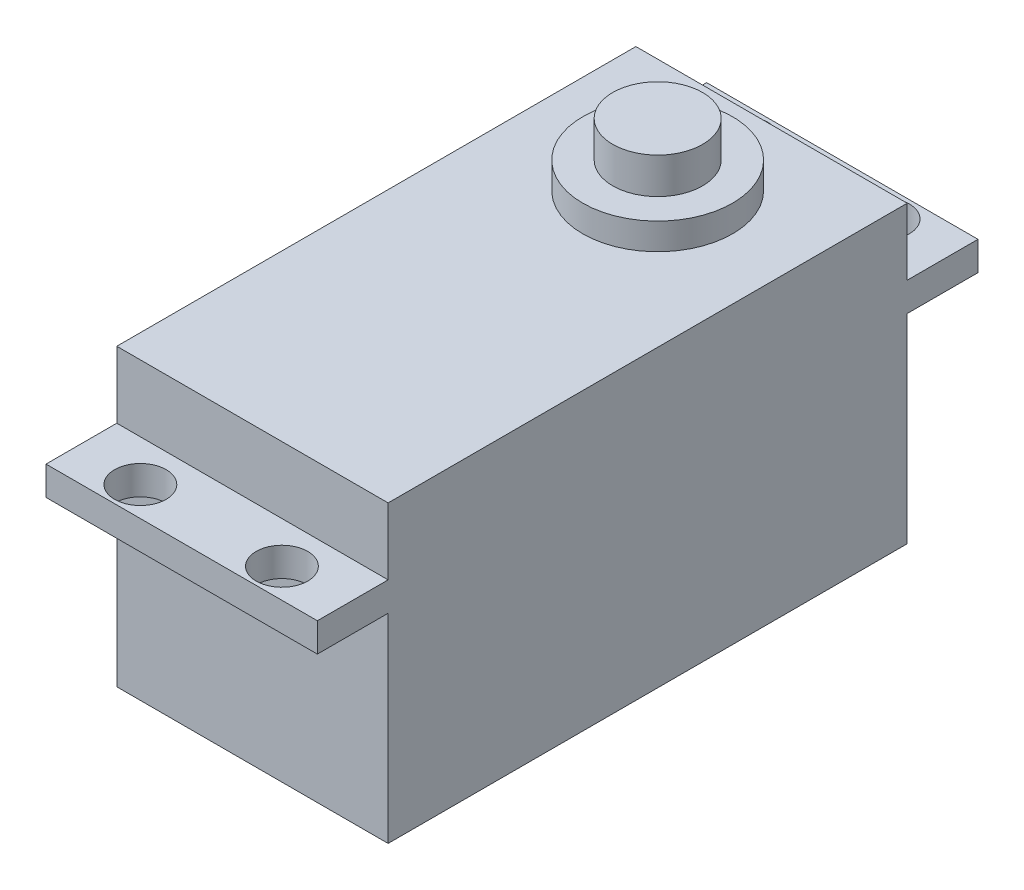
from build123d import *

# Parameters (mm, degrees)
SKETCH1_W               = 23
SKETCH1_H               = 44
EXTRUDE1_DEPTH          = 25
SKETCH3_W               = 23
SKETCH3_H               = 2.45
EXTRUDE3_DEPTH          = 6
SKETCH5_R               = 2.1844
CUT_EXTRUDE1_DEPTH      = 36.925930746
MIRROR3_COPY_1_SKETCH_R = 2.1844
MIRROR3_COPY_1_DEPTH    = 36.925930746
SKETCH4_R               = 6.35
EXTRUDE4_DEPTH          = 2.252
SKETCH6_R               = 3.81
EXTRUDE5_DEPTH          = 3.048


with BuildPart() as part:
    # Sketch1 → Extrude1 (new body)
    with BuildSketch(Plane(origin=(0, 0, 0), x_dir=(1, 0, 0), z_dir=(0, 1, 0))):
        Rectangle(SKETCH1_W, SKETCH1_H)
    extrude(amount=EXTRUDE1_DEPTH)

    # Sketch3 → Extrude3 (add)
    with BuildSketch(Plane.XY.offset(22)):
        with Locations((0, 18.125)):
            Rectangle(SKETCH3_W, SKETCH3_H)
    extrude3 = extrude(amount=EXTRUDE3_DEPTH)

    # Mirror1: Extrude3 across plane
    add(extrude3.mirror(Plane.XY))

    # Sketch5 → Cut-Extrude1 (cut, through all)
    with BuildSketch(Plane(origin=(0, 19.35, 0), x_dir=(1, 0, 0), z_dir=(0, 1, 0))):
        with Locations(Location((6, -25.5, 0), (0, 0, 270))):
            Circle(SKETCH5_R)
    cut_extrude1 = extrude(amount=-CUT_EXTRUDE1_DEPTH, mode=Mode.SUBTRACT)

    # Mirror2: Cut-Extrude1 across plane
    add(cut_extrude1.mirror(Plane.XY), mode=Mode.SUBTRACT)

    # Mirror3: Cut-Extrude1 across plane
    add(cut_extrude1.mirror(Plane(origin=(0, 0, 0), x_dir=(0, 0, 1), z_dir=(1, 0, 0))), mode=Mode.SUBTRACT)

    # Mirror3 copy 1 sketch → Mirror3 copy 1 (cut, through all)
    with BuildSketch(Plane(origin=(0, 19.35, 0), x_dir=(-1, 0, 0), z_dir=(0, 1, 0))):
        with Locations(Location((6, -25.5, 0), (0, 0, 270))):
            Circle(MIRROR3_COPY_1_SKETCH_R)
    extrude(amount=-MIRROR3_COPY_1_DEPTH, mode=Mode.SUBTRACT)

    # Sketch4 → Extrude4 (add)
    with BuildSketch(Plane(origin=(0, 25, 0), x_dir=(1, 0, 0), z_dir=(0, 1, 0))):
        with Locations(Location((0, 12.348, 0), (0, 0, 270))):
            Circle(SKETCH4_R)
    extrude(amount=EXTRUDE4_DEPTH)

    # Sketch6 → Extrude5 (add)
    with BuildSketch(Plane(origin=(0, 27.252, 0), x_dir=(1, 0, 0), z_dir=(0, 1, 0))):
        with Locations(Location((0, 12.348, 0), (0, 0, 90))):
            Circle(SKETCH6_R)
    extrude(amount=EXTRUDE5_DEPTH)


solid = part.part
